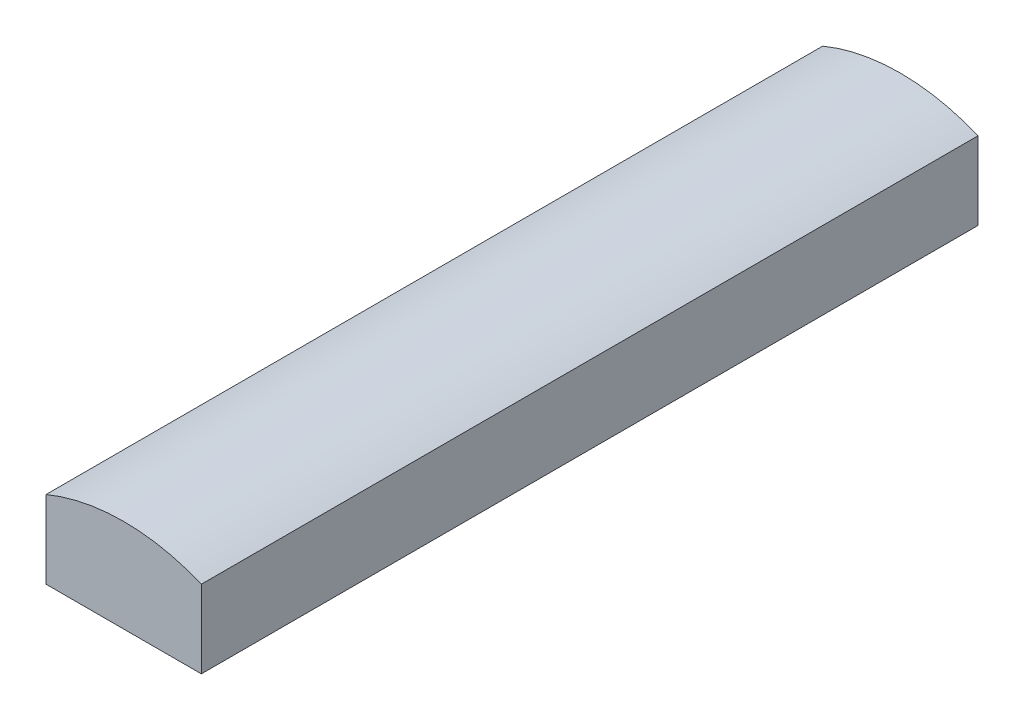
ISO-10303-21;
HEADER;
FILE_DESCRIPTION(('STEP AP214'),'2;1');
FILE_NAME('part.step','',(''),(''),'','','');
FILE_SCHEMA(('AUTOMOTIVE_DESIGN { 1 0 10303 214 1 1 1 1 }'));
ENDSEC;
DATA;
#1=APPLICATION_CONTEXT('core data for automotive mechanical design processes');
#2=APPLICATION_PROTOCOL_DEFINITION('international standard','automotive_design',2000,#1);
#3=PRODUCT_CONTEXT('',#1,'mechanical');
#4=PRODUCT('Part','Part','',(#3));
#5=PRODUCT_RELATED_PRODUCT_CATEGORY('part','',(#4));
#6=PRODUCT_DEFINITION_FORMATION('','',#4);
#7=PRODUCT_DEFINITION_CONTEXT('part definition',#1,'design');
#8=PRODUCT_DEFINITION('design','',#6,#7);
#9=PRODUCT_DEFINITION_SHAPE('','',#8);
#10=(LENGTH_UNIT() NAMED_UNIT(*) SI_UNIT(.MILLI.,.METRE.));
#11=(NAMED_UNIT(*) PLANE_ANGLE_UNIT() SI_UNIT($,.RADIAN.));
#12=(NAMED_UNIT(*) SI_UNIT($,.STERADIAN.) SOLID_ANGLE_UNIT());
#13=UNCERTAINTY_MEASURE_WITH_UNIT(LENGTH_MEASURE(1.E-05),#10,'distance_accuracy_value','');
#14=(GEOMETRIC_REPRESENTATION_CONTEXT(3) GLOBAL_UNCERTAINTY_ASSIGNED_CONTEXT((#13)) GLOBAL_UNIT_ASSIGNED_CONTEXT((#10,
#11,#12)) REPRESENTATION_CONTEXT('',''));
#15=CARTESIAN_POINT('',(0.,0.,0.));
#16=DIRECTION('',(0.,0.,1.));
#17=DIRECTION('',(1.,0.,0.));
#18=AXIS2_PLACEMENT_3D('',#15,#16,#17);
#19=CARTESIAN_POINT('',(550.000000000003,0.,-500.));
#20=DIRECTION('',(0.,-1.,0.));
#21=DIRECTION('',(0.,0.,-1.));
#22=AXIS2_PLACEMENT_3D('',#19,#20,#21);
#23=PLANE('',#22);
#24=CARTESIAN_POINT('',(500.950908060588,0.,-479.345692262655));
#25=DIRECTION('',(0.,-1.,0.));
#26=DIRECTION('',(0.,0.,-1.));
#27=AXIS2_PLACEMENT_3D('',#24,#25,#26);
#28=CIRCLE('',#27,0.0500000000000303);
#29=CARTESIAN_POINT('',(500.950908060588,0.,-479.395692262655));
#30=VERTEX_POINT('',#29);
#31=EDGE_CURVE('E78',#30,#30,#28,.T.);
#32=ORIENTED_EDGE('',*,*,#31,.F.);
#33=EDGE_LOOP('',(#32));
#34=FACE_BOUND('',#33,.T.);
#35=DIRECTION('',(0.,0.,1.));
#36=VECTOR('',#35,1.);
#37=CARTESIAN_POINT('',(550.000000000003,0.,-500.));
#38=LINE('',#37,#36);
#39=CARTESIAN_POINT('',(550.000000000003,0.,-500.));
#40=VERTEX_POINT('',#39);
#41=CARTESIAN_POINT('',(550.000000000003,0.,-0.099999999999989));
#42=VERTEX_POINT('',#41);
#43=EDGE_CURVE('E40',#40,#42,#38,.T.);
#44=ORIENTED_EDGE('',*,*,#43,.T.);
#45=DIRECTION('',(-1.,0.,0.));
#46=VECTOR('',#45,1.);
#47=CARTESIAN_POINT('',(450.000000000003,0.,-0.099999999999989));
#48=LINE('',#47,#46);
#49=CARTESIAN_POINT('',(450.000000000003,0.,-0.100000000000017));
#50=VERTEX_POINT('',#49);
#51=EDGE_CURVE('E73',#42,#50,#48,.T.);
#52=ORIENTED_EDGE('',*,*,#51,.T.);
#53=DIRECTION('',(0.,0.,1.));
#54=VECTOR('',#53,1.);
#55=CARTESIAN_POINT('',(450.000000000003,0.,-500.));
#56=LINE('',#55,#54);
#57=CARTESIAN_POINT('',(450.000000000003,0.,-500.));
#58=VERTEX_POINT('',#57);
#59=EDGE_CURVE('E83',#58,#50,#56,.T.);
#60=ORIENTED_EDGE('',*,*,#59,.F.);
#61=DIRECTION('',(1.,0.,0.));
#62=VECTOR('',#61,1.);
#63=CARTESIAN_POINT('',(550.000000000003,0.,-500.));
#64=LINE('',#63,#62);
#65=EDGE_CURVE('E96',#58,#40,#64,.T.);
#66=ORIENTED_EDGE('',*,*,#65,.T.);
#67=EDGE_LOOP('',(#44,#52,#60,#66));
#68=FACE_BOUND('',#67,.T.);
#69=ADVANCED_FACE('F31',(#34,#68),#23,.T.);
#70=CARTESIAN_POINT('',(500.000000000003,-70.0000000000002,-500.));
#71=DIRECTION('',(0.,0.,1.));
#72=DIRECTION('',(1.,0.,0.));
#73=AXIS2_PLACEMENT_3D('',#70,#71,#72);
#74=CYLINDRICAL_SURFACE('',#73,130.);
#75=DIRECTION('',(0.,0.,1.));
#76=VECTOR('',#75,1.);
#77=CARTESIAN_POINT('',(450.000000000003,50.,-500.));
#78=LINE('',#77,#76);
#79=CARTESIAN_POINT('',(450.000000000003,50.,-500.));
#80=VERTEX_POINT('',#79);
#81=CARTESIAN_POINT('',(450.000000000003,50.,-0.099999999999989));
#82=VERTEX_POINT('',#81);
#83=EDGE_CURVE('E35',#80,#82,#78,.T.);
#84=ORIENTED_EDGE('',*,*,#83,.T.);
#85=CARTESIAN_POINT('',(500.000000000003,-70.0000000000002,-0.099999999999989));
#86=DIRECTION('',(0.,0.,1.));
#87=DIRECTION('',(1.,0.,0.));
#88=AXIS2_PLACEMENT_3D('',#85,#86,#87);
#89=CIRCLE('',#88,130.);
#90=CARTESIAN_POINT('',(550.000000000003,50.,-0.099999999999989));
#91=VERTEX_POINT('',#90);
#92=EDGE_CURVE('E48',#82,#91,#89,.F.);
#93=ORIENTED_EDGE('',*,*,#92,.T.);
#94=DIRECTION('',(0.,0.,1.));
#95=VECTOR('',#94,1.);
#96=CARTESIAN_POINT('',(550.000000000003,50.,-500.));
#97=LINE('',#96,#95);
#98=CARTESIAN_POINT('',(550.000000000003,50.,-500.));
#99=VERTEX_POINT('',#98);
#100=EDGE_CURVE('E11',#99,#91,#97,.T.);
#101=ORIENTED_EDGE('',*,*,#100,.F.);
#102=CARTESIAN_POINT('',(500.000000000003,-70.0000000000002,-500.));
#103=DIRECTION('',(0.,0.,1.));
#104=DIRECTION('',(-1.,0.,0.));
#105=AXIS2_PLACEMENT_3D('',#102,#103,#104);
#106=CIRCLE('',#105,130.);
#107=EDGE_CURVE('E99',#99,#80,#106,.T.);
#108=ORIENTED_EDGE('',*,*,#107,.T.);
#109=EDGE_LOOP('',(#84,#93,#101,#108));
#110=FACE_BOUND('',#109,.T.);
#111=ADVANCED_FACE('F33',(#110),#74,.T.);
#112=CARTESIAN_POINT('',(550.000000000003,50.,-500.));
#113=DIRECTION('',(1.,0.,0.));
#114=DIRECTION('',(0.,0.,-1.));
#115=AXIS2_PLACEMENT_3D('',#112,#113,#114);
#116=PLANE('',#115);
#117=ORIENTED_EDGE('',*,*,#100,.T.);
#118=DIRECTION('',(0.,-1.,0.));
#119=VECTOR('',#118,1.);
#120=CARTESIAN_POINT('',(550.000000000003,0.,-0.099999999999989));
#121=LINE('',#120,#119);
#122=EDGE_CURVE('E85',#91,#42,#121,.T.);
#123=ORIENTED_EDGE('',*,*,#122,.T.);
#124=ORIENTED_EDGE('',*,*,#43,.F.);
#125=DIRECTION('',(0.,1.,0.));
#126=VECTOR('',#125,1.);
#127=CARTESIAN_POINT('',(550.000000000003,50.,-500.));
#128=LINE('',#127,#126);
#129=EDGE_CURVE('E92',#40,#99,#128,.T.);
#130=ORIENTED_EDGE('',*,*,#129,.T.);
#131=EDGE_LOOP('',(#117,#123,#124,#130));
#132=FACE_BOUND('',#131,.T.);
#133=ADVANCED_FACE('F108',(#132),#116,.T.);
#134=CARTESIAN_POINT('',(450.000000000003,0.,-500.));
#135=DIRECTION('',(-1.,0.,0.));
#136=DIRECTION('',(0.,0.,1.));
#137=AXIS2_PLACEMENT_3D('',#134,#135,#136);
#138=PLANE('',#137);
#139=ORIENTED_EDGE('',*,*,#59,.T.);
#140=DIRECTION('',(0.,1.,0.));
#141=VECTOR('',#140,1.);
#142=CARTESIAN_POINT('',(450.000000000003,50.,-0.099999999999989));
#143=LINE('',#142,#141);
#144=EDGE_CURVE('E70',#50,#82,#143,.T.);
#145=ORIENTED_EDGE('',*,*,#144,.T.);
#146=ORIENTED_EDGE('',*,*,#83,.F.);
#147=DIRECTION('',(0.,-1.,0.));
#148=VECTOR('',#147,1.);
#149=CARTESIAN_POINT('',(450.000000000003,0.,-500.));
#150=LINE('',#149,#148);
#151=EDGE_CURVE('E90',#80,#58,#150,.T.);
#152=ORIENTED_EDGE('',*,*,#151,.T.);
#153=EDGE_LOOP('',(#139,#145,#146,#152));
#154=FACE_BOUND('',#153,.T.);
#155=ADVANCED_FACE('F88',(#154),#138,.T.);
#156=CARTESIAN_POINT('',(500.000000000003,-70.0000000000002,-500.));
#157=DIRECTION('',(0.,0.,-1.));
#158=DIRECTION('',(-1.,0.,0.));
#159=AXIS2_PLACEMENT_3D('',#156,#157,#158);
#160=PLANE('',#159);
#161=ORIENTED_EDGE('',*,*,#107,.F.);
#162=ORIENTED_EDGE('',*,*,#129,.F.);
#163=ORIENTED_EDGE('',*,*,#65,.F.);
#164=ORIENTED_EDGE('',*,*,#151,.F.);
#165=EDGE_LOOP('',(#161,#162,#163,#164));
#166=FACE_BOUND('',#165,.T.);
#167=ADVANCED_FACE('F110',(#166),#160,.T.);
#168=CARTESIAN_POINT('',(500.950908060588,-0.1,-479.345692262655));
#169=DIRECTION('',(0.,1.,0.));
#170=DIRECTION('',(0.,0.,1.));
#171=AXIS2_PLACEMENT_3D('',#168,#169,#170);
#172=CYLINDRICAL_SURFACE('',#171,0.0500000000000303);
#173=CARTESIAN_POINT('',(500.950908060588,-0.1,-479.345692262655));
#174=DIRECTION('',(0.,-1.,0.));
#175=DIRECTION('',(0.,0.,-1.));
#176=AXIS2_PLACEMENT_3D('',#173,#174,#175);
#177=CIRCLE('',#176,0.0500000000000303);
#178=CARTESIAN_POINT('',(500.950908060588,-0.1,-479.395692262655));
#179=VERTEX_POINT('',#178);
#180=EDGE_CURVE('E101',#179,#179,#177,.T.);
#181=ORIENTED_EDGE('',*,*,#180,.F.);
#182=EDGE_LOOP('',(#181));
#183=FACE_BOUND('',#182,.T.);
#184=ORIENTED_EDGE('',*,*,#31,.T.);
#185=EDGE_LOOP('',(#184));
#186=FACE_BOUND('',#185,.T.);
#187=ADVANCED_FACE('F113',(#183,#186),#172,.T.);
#188=CARTESIAN_POINT('',(500.950908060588,-0.1,-479.345692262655));
#189=DIRECTION('',(0.,-1.,0.));
#190=DIRECTION('',(0.,0.,-1.));
#191=AXIS2_PLACEMENT_3D('',#188,#189,#190);
#192=PLANE('',#191);
#193=ORIENTED_EDGE('',*,*,#180,.T.);
#194=EDGE_LOOP('',(#193));
#195=FACE_BOUND('',#194,.T.);
#196=ADVANCED_FACE('F119',(#195),#192,.T.);
#197=CARTESIAN_POINT('',(450.000000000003,0.,-0.099999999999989));
#198=DIRECTION('',(0.,0.,1.));
#199=DIRECTION('',(1.,0.,0.));
#200=AXIS2_PLACEMENT_3D('',#197,#198,#199);
#201=PLANE('',#200);
#202=ORIENTED_EDGE('',*,*,#92,.F.);
#203=ORIENTED_EDGE('',*,*,#144,.F.);
#204=ORIENTED_EDGE('',*,*,#51,.F.);
#205=ORIENTED_EDGE('',*,*,#122,.F.);
#206=EDGE_LOOP('',(#202,#203,#204,#205));
#207=FACE_BOUND('',#206,.T.);
#208=ADVANCED_FACE('F72',(#207),#201,.T.);
#209=CLOSED_SHELL('',(#69,#111,#133,#155,#167,#187,#196,#208));
#210=MANIFOLD_SOLID_BREP('B2',#209);
#211=ADVANCED_BREP_SHAPE_REPRESENTATION('',(#18,#210),#14);
#212=SHAPE_DEFINITION_REPRESENTATION(#9,#211);
ENDSEC;
END-ISO-10303-21;
